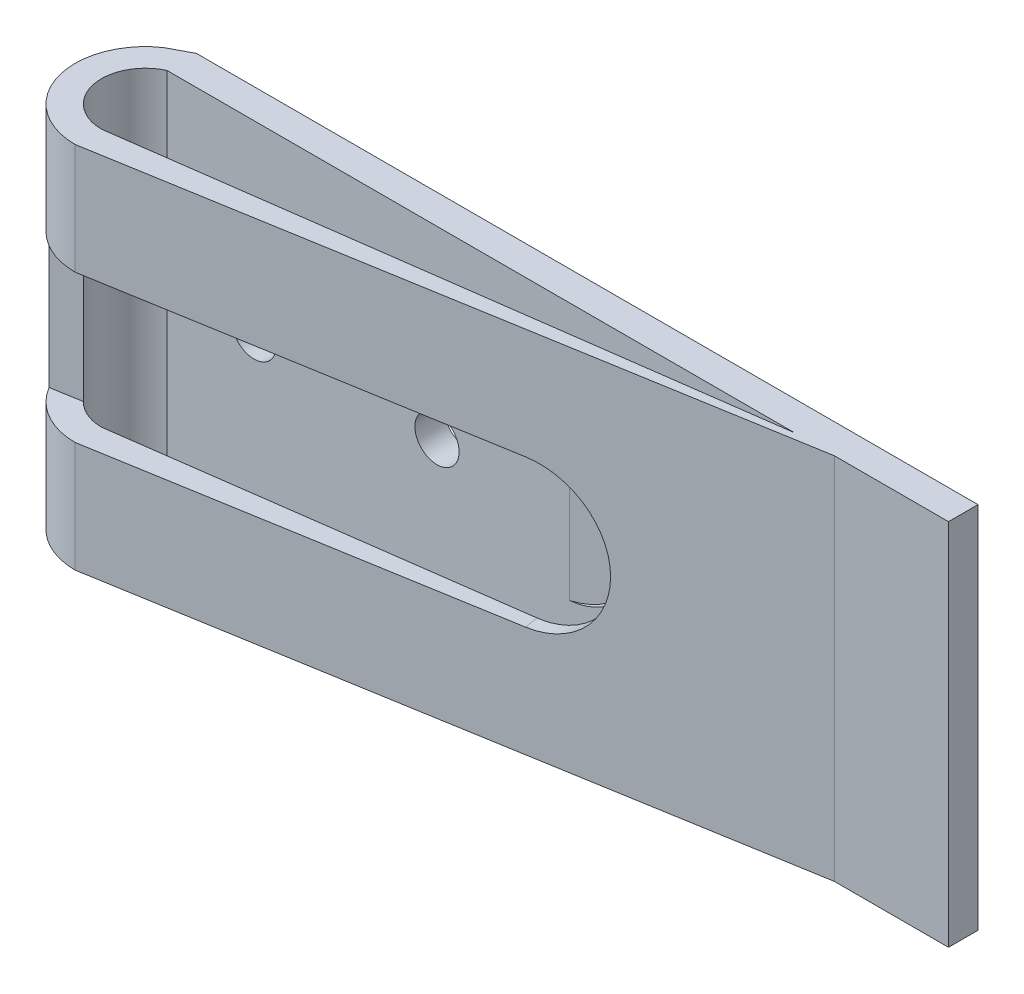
ISO-10303-21;
HEADER;
FILE_DESCRIPTION(('STEP AP214'),'2;1');
FILE_NAME('part.step','',(''),(''),'','','');
FILE_SCHEMA(('AUTOMOTIVE_DESIGN { 1 0 10303 214 1 1 1 1 }'));
ENDSEC;
DATA;
#1=APPLICATION_CONTEXT('core data for automotive mechanical design processes');
#2=APPLICATION_PROTOCOL_DEFINITION('international standard','automotive_design',2000,#1);
#3=PRODUCT_CONTEXT('',#1,'mechanical');
#4=PRODUCT('Part','Part','',(#3));
#5=PRODUCT_RELATED_PRODUCT_CATEGORY('part','',(#4));
#6=PRODUCT_DEFINITION_FORMATION('','',#4);
#7=PRODUCT_DEFINITION_CONTEXT('part definition',#1,'design');
#8=PRODUCT_DEFINITION('design','',#6,#7);
#9=PRODUCT_DEFINITION_SHAPE('','',#8);
#10=(LENGTH_UNIT() NAMED_UNIT(*) SI_UNIT(.MILLI.,.METRE.));
#11=(NAMED_UNIT(*) PLANE_ANGLE_UNIT() SI_UNIT($,.RADIAN.));
#12=(NAMED_UNIT(*) SI_UNIT($,.STERADIAN.) SOLID_ANGLE_UNIT());
#13=UNCERTAINTY_MEASURE_WITH_UNIT(LENGTH_MEASURE(1.E-05),#10,'distance_accuracy_value','');
#14=(GEOMETRIC_REPRESENTATION_CONTEXT(3) GLOBAL_UNCERTAINTY_ASSIGNED_CONTEXT((#13)) GLOBAL_UNIT_ASSIGNED_CONTEXT((#10,
#11,#12)) REPRESENTATION_CONTEXT('',''));
#15=CARTESIAN_POINT('',(0.,0.,0.));
#16=DIRECTION('',(0.,0.,1.));
#17=DIRECTION('',(1.,0.,0.));
#18=AXIS2_PLACEMENT_3D('',#15,#16,#17);
#19=CARTESIAN_POINT('',(0.,0.,2.));
#20=DIRECTION('',(0.,0.,1.));
#21=DIRECTION('',(1.,0.,0.));
#22=AXIS2_PLACEMENT_3D('',#19,#20,#21);
#23=PLANE('',#22);
#24=DIRECTION('',(0.,-1.,0.));
#25=VECTOR('',#24,1.);
#26=CARTESIAN_POINT('',(18.7566600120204,12.5,2.));
#27=LINE('',#26,#25);
#28=CARTESIAN_POINT('',(18.7566600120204,12.5,2.));
#29=VERTEX_POINT('',#28);
#30=CARTESIAN_POINT('',(18.7566600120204,-12.5,2.));
#31=VERTEX_POINT('',#30);
#32=EDGE_CURVE('E261',#29,#31,#27,.T.);
#33=ORIENTED_EDGE('',*,*,#32,.T.);
#34=DIRECTION('',(1.,0.,0.));
#35=VECTOR('',#34,1.);
#36=CARTESIAN_POINT('',(-26.5,-12.5,2.));
#37=LINE('',#36,#35);
#38=CARTESIAN_POINT('',(26.5,-12.5,2.));
#39=VERTEX_POINT('',#38);
#40=EDGE_CURVE('E292',#31,#39,#37,.T.);
#41=ORIENTED_EDGE('',*,*,#40,.T.);
#42=DIRECTION('',(0.,1.,0.));
#43=VECTOR('',#42,1.);
#44=CARTESIAN_POINT('',(26.5,12.5,2.));
#45=LINE('',#44,#43);
#46=CARTESIAN_POINT('',(26.5,12.5,2.));
#47=VERTEX_POINT('',#46);
#48=EDGE_CURVE('E297',#39,#47,#45,.T.);
#49=ORIENTED_EDGE('',*,*,#48,.T.);
#50=DIRECTION('',(-1.,0.,0.));
#51=VECTOR('',#50,1.);
#52=CARTESIAN_POINT('',(-26.5,12.5,2.));
#53=LINE('',#52,#51);
#54=EDGE_CURVE('E301',#47,#29,#53,.T.);
#55=ORIENTED_EDGE('',*,*,#54,.T.);
#56=EDGE_LOOP('',(#33,#41,#49,#55));
#57=FACE_BOUND('',#56,.T.);
#58=ADVANCED_FACE('F45',(#57),#23,.T.);
#59=CARTESIAN_POINT('',(0.33904173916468,0.,2.));
#60=DIRECTION('',(0.,0.,1.));
#61=DIRECTION('',(1.,0.,0.));
#62=AXIS2_PLACEMENT_3D('',#59,#60,#61);
#63=ELLIPSE('',#62,5.07133445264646,5.00000000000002);
#64=CARTESIAN_POINT('',(0.807243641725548,-4.97864545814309,2.));
#65=VERTEX_POINT('',#64);
#66=CARTESIAN_POINT('',(0.807243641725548,4.97864545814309,2.));
#67=VERTEX_POINT('',#66);
#68=EDGE_CURVE('E209',#65,#67,#63,.T.);
#69=ORIENTED_EDGE('',*,*,#68,.F.);
#70=DIRECTION('',(0.,1.,0.));
#71=VECTOR('',#70,1.);
#72=CARTESIAN_POINT('',(0.807243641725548,0.,2.));
#73=LINE('',#72,#71);
#74=EDGE_CURVE('E194',#65,#67,#73,.T.);
#75=ORIENTED_EDGE('',*,*,#74,.T.);
#76=EDGE_LOOP('',(#69,#75));
#77=FACE_BOUND('',#76,.T.);
#78=DIRECTION('',(0.,-1.,0.));
#79=VECTOR('',#78,1.);
#80=CARTESIAN_POINT('',(16.0699554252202,12.5,2.));
#81=LINE('',#80,#79);
#82=CARTESIAN_POINT('',(16.0699554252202,12.5,2.));
#83=VERTEX_POINT('',#82);
#84=CARTESIAN_POINT('',(16.0699554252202,-12.5,2.));
#85=VERTEX_POINT('',#84);
#86=EDGE_CURVE('E264',#83,#85,#81,.T.);
#87=ORIENTED_EDGE('',*,*,#86,.F.);
#88=CARTESIAN_POINT('',(-26.5,12.5,2.));
#89=VERTEX_POINT('',#88);
#90=EDGE_CURVE('E300',#83,#89,#53,.T.);
#91=ORIENTED_EDGE('',*,*,#90,.T.);
#92=DIRECTION('',(0.,-1.,0.));
#93=VECTOR('',#92,1.);
#94=CARTESIAN_POINT('',(-26.5,12.5,2.));
#95=LINE('',#94,#93);
#96=CARTESIAN_POINT('',(-26.5,-12.5,2.));
#97=VERTEX_POINT('',#96);
#98=EDGE_CURVE('E288',#89,#97,#95,.T.);
#99=ORIENTED_EDGE('',*,*,#98,.T.);
#100=EDGE_CURVE('E294',#97,#85,#37,.T.);
#101=ORIENTED_EDGE('',*,*,#100,.T.);
#102=EDGE_LOOP('',(#87,#91,#99,#101));
#103=FACE_BOUND('',#102,.T.);
#104=CARTESIAN_POINT('',(-20.5983535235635,0.,2.));
#105=DIRECTION('',(0.,0.,1.));
#106=DIRECTION('',(1.,0.,0.));
#107=AXIS2_PLACEMENT_3D('',#104,#105,#106);
#108=CIRCLE('',#107,1.5);
#109=CARTESIAN_POINT('',(-19.0983535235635,0.,2.));
#110=VERTEX_POINT('',#109);
#111=EDGE_CURVE('E280',#110,#110,#108,.T.);
#112=ORIENTED_EDGE('',*,*,#111,.F.);
#113=EDGE_LOOP('',(#112));
#114=FACE_BOUND('',#113,.T.);
#115=CARTESIAN_POINT('',(-8.1881653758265,0.,2.));
#116=DIRECTION('',(0.,0.,1.));
#117=DIRECTION('',(1.,0.,0.));
#118=AXIS2_PLACEMENT_3D('',#115,#116,#117);
#119=CIRCLE('',#118,1.5);
#120=CARTESIAN_POINT('',(-6.6881653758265,0.,2.));
#121=VERTEX_POINT('',#120);
#122=EDGE_CURVE('E272',#121,#121,#119,.T.);
#123=ORIENTED_EDGE('',*,*,#122,.F.);
#124=EDGE_LOOP('',(#123));
#125=FACE_BOUND('',#124,.T.);
#126=ADVANCED_FACE('F357',(#77,#103,#114,#125),#23,.T.);
#127=CARTESIAN_POINT('',(0.,0.,0.));
#128=DIRECTION('',(0.,0.,1.));
#129=DIRECTION('',(1.,0.,0.));
#130=AXIS2_PLACEMENT_3D('',#127,#128,#129);
#131=PLANE('',#130);
#132=DIRECTION('',(0.,-1.,0.));
#133=VECTOR('',#132,1.);
#134=CARTESIAN_POINT('',(-26.5,12.5,0.));
#135=LINE('',#134,#133);
#136=CARTESIAN_POINT('',(-26.5,12.5,0.));
#137=VERTEX_POINT('',#136);
#138=CARTESIAN_POINT('',(-26.5,-12.5,0.));
#139=VERTEX_POINT('',#138);
#140=EDGE_CURVE('E284',#137,#139,#135,.T.);
#141=ORIENTED_EDGE('',*,*,#140,.F.);
#142=DIRECTION('',(-1.,0.,0.));
#143=VECTOR('',#142,1.);
#144=CARTESIAN_POINT('',(-26.5,12.5,0.));
#145=LINE('',#144,#143);
#146=CARTESIAN_POINT('',(26.5,12.5,0.));
#147=VERTEX_POINT('',#146);
#148=EDGE_CURVE('E293',#147,#137,#145,.T.);
#149=ORIENTED_EDGE('',*,*,#148,.F.);
#150=DIRECTION('',(0.,1.,0.));
#151=VECTOR('',#150,1.);
#152=CARTESIAN_POINT('',(26.5,12.5,0.));
#153=LINE('',#152,#151);
#154=CARTESIAN_POINT('',(26.5,-12.5,0.));
#155=VERTEX_POINT('',#154);
#156=EDGE_CURVE('E311',#155,#147,#153,.T.);
#157=ORIENTED_EDGE('',*,*,#156,.F.);
#158=DIRECTION('',(1.,0.,0.));
#159=VECTOR('',#158,1.);
#160=CARTESIAN_POINT('',(-26.5,-12.5,0.));
#161=LINE('',#160,#159);
#162=EDGE_CURVE('E308',#139,#155,#161,.T.);
#163=ORIENTED_EDGE('',*,*,#162,.F.);
#164=EDGE_LOOP('',(#141,#149,#157,#163));
#165=FACE_BOUND('',#164,.T.);
#166=CARTESIAN_POINT('',(-20.5983535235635,0.,0.));
#167=DIRECTION('',(0.,0.,1.));
#168=DIRECTION('',(1.,0.,0.));
#169=AXIS2_PLACEMENT_3D('',#166,#167,#168);
#170=CIRCLE('',#169,1.5);
#171=CARTESIAN_POINT('',(-19.0983535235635,0.,0.));
#172=VERTEX_POINT('',#171);
#173=EDGE_CURVE('E276',#172,#172,#170,.T.);
#174=ORIENTED_EDGE('',*,*,#173,.T.);
#175=EDGE_LOOP('',(#174));
#176=FACE_BOUND('',#175,.T.);
#177=CARTESIAN_POINT('',(-8.1881653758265,0.,0.));
#178=DIRECTION('',(0.,0.,1.));
#179=DIRECTION('',(1.,0.,0.));
#180=AXIS2_PLACEMENT_3D('',#177,#178,#179);
#181=CIRCLE('',#180,1.5);
#182=CARTESIAN_POINT('',(-6.6881653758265,0.,0.));
#183=VERTEX_POINT('',#182);
#184=EDGE_CURVE('E256',#183,#183,#181,.T.);
#185=ORIENTED_EDGE('',*,*,#184,.T.);
#186=EDGE_LOOP('',(#185));
#187=FACE_BOUND('',#186,.T.);
#188=ADVANCED_FACE('F385',(#165,#176,#187),#131,.F.);
#189=CARTESIAN_POINT('',(-26.5,-12.5,2.));
#190=DIRECTION('',(0.,1.,0.));
#191=DIRECTION('',(0.,0.,1.));
#192=AXIS2_PLACEMENT_3D('',#189,#190,#191);
#193=PLANE('',#192);
#194=DIRECTION('',(0.884045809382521,0.,-0.467400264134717));
#195=VECTOR('',#194,1.);
#196=CARTESIAN_POINT('',(-26.5,-12.5,0.));
#197=LINE('',#196,#195);
#198=CARTESIAN_POINT('',(-27.9487701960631,-12.5,0.765973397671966));
#199=VERTEX_POINT('',#198);
#200=EDGE_CURVE('E218',#199,#139,#197,.T.);
#201=ORIENTED_EDGE('',*,*,#200,.T.);
#202=ORIENTED_EDGE('',*,*,#162,.T.);
#203=DIRECTION('',(0.,0.,-1.));
#204=VECTOR('',#203,1.);
#205=CARTESIAN_POINT('',(26.5,-12.5,2.));
#206=LINE('',#205,#204);
#207=EDGE_CURVE('E320',#39,#155,#206,.T.);
#208=ORIENTED_EDGE('',*,*,#207,.F.);
#209=ORIENTED_EDGE('',*,*,#40,.F.);
#210=DIRECTION('',(-0.985933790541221,0.,0.16713635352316));
#211=VECTOR('',#210,1.);
#212=CARTESIAN_POINT('',(-25.270115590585,-12.5,9.46345728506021));
#213=LINE('',#212,#211);
#214=CARTESIAN_POINT('',(-25.270115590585,-12.5,9.46345728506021));
#215=VERTEX_POINT('',#214);
#216=EDGE_CURVE('E242',#31,#215,#213,.T.);
#217=ORIENTED_EDGE('',*,*,#216,.T.);
#218=CARTESIAN_POINT('',(-25.270115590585,-12.5,4.70222877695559));
#219=DIRECTION('',(0.,-1.,0.));
#220=DIRECTION('',(0.,0.,-1.));
#221=AXIS2_PLACEMENT_3D('',#218,#219,#220);
#222=CIRCLE('',#221,4.76122850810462);
#223=EDGE_CURVE('E246',#215,#199,#222,.T.);
#224=ORIENTED_EDGE('',*,*,#223,.T.);
#225=EDGE_LOOP('',(#201,#202,#208,#209,#217,#224));
#226=FACE_BOUND('',#225,.T.);
#227=ORIENTED_EDGE('',*,*,#100,.F.);
#228=CARTESIAN_POINT('',(-25.270115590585,-12.5,4.70222877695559));
#229=DIRECTION('',(0.,1.,0.));
#230=DIRECTION('',(0.,0.,-1.));
#231=AXIS2_PLACEMENT_3D('',#228,#229,#230);
#232=CIRCLE('',#231,2.96894863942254);
#233=CARTESIAN_POINT('',(-25.270115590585,-12.5,7.67117741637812));
#234=VERTEX_POINT('',#233);
#235=EDGE_CURVE('E212',#97,#234,#232,.T.);
#236=ORIENTED_EDGE('',*,*,#235,.T.);
#237=DIRECTION('',(0.990721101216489,0.,-0.135910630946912));
#238=VECTOR('',#237,1.);
#239=CARTESIAN_POINT('',(-25.270115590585,-12.5,7.67117741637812));
#240=LINE('',#239,#238);
#241=EDGE_CURVE('E238',#234,#85,#240,.T.);
#242=ORIENTED_EDGE('',*,*,#241,.T.);
#243=EDGE_LOOP('',(#227,#236,#242));
#244=FACE_BOUND('',#243,.T.);
#245=ADVANCED_FACE('F47',(#226,#244),#193,.F.);
#246=CARTESIAN_POINT('',(26.5,12.5,2.));
#247=DIRECTION('',(-1.,0.,0.));
#248=DIRECTION('',(0.,-1.,0.));
#249=AXIS2_PLACEMENT_3D('',#246,#247,#248);
#250=PLANE('',#249);
#251=ORIENTED_EDGE('',*,*,#156,.T.);
#252=DIRECTION('',(0.,0.,-1.));
#253=VECTOR('',#252,1.);
#254=CARTESIAN_POINT('',(26.5,12.5,2.));
#255=LINE('',#254,#253);
#256=EDGE_CURVE('E304',#47,#147,#255,.T.);
#257=ORIENTED_EDGE('',*,*,#256,.F.);
#258=ORIENTED_EDGE('',*,*,#48,.F.);
#259=ORIENTED_EDGE('',*,*,#207,.T.);
#260=EDGE_LOOP('',(#251,#257,#258,#259));
#261=FACE_BOUND('',#260,.T.);
#262=ADVANCED_FACE('F391',(#261),#250,.F.);
#263=CARTESIAN_POINT('',(-26.5,12.5,2.));
#264=DIRECTION('',(0.,-1.,0.));
#265=DIRECTION('',(0.,0.,-1.));
#266=AXIS2_PLACEMENT_3D('',#263,#264,#265);
#267=PLANE('',#266);
#268=ORIENTED_EDGE('',*,*,#148,.T.);
#269=DIRECTION('',(0.884045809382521,0.,-0.467400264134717));
#270=VECTOR('',#269,1.);
#271=CARTESIAN_POINT('',(-26.5,12.5,0.));
#272=LINE('',#271,#270);
#273=CARTESIAN_POINT('',(-27.9487701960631,12.5,0.765973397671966));
#274=VERTEX_POINT('',#273);
#275=EDGE_CURVE('E230',#274,#137,#272,.T.);
#276=ORIENTED_EDGE('',*,*,#275,.F.);
#277=CARTESIAN_POINT('',(-25.270115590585,12.5,4.70222877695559));
#278=DIRECTION('',(0.,-1.,0.));
#279=DIRECTION('',(0.,0.,-1.));
#280=AXIS2_PLACEMENT_3D('',#277,#278,#279);
#281=CIRCLE('',#280,4.76122850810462);
#282=CARTESIAN_POINT('',(-25.270115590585,12.5,9.46345728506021));
#283=VERTEX_POINT('',#282);
#284=EDGE_CURVE('E226',#283,#274,#281,.T.);
#285=ORIENTED_EDGE('',*,*,#284,.F.);
#286=DIRECTION('',(-0.985933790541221,0.,0.16713635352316));
#287=VECTOR('',#286,1.);
#288=CARTESIAN_POINT('',(-25.270115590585,12.5,9.46345728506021));
#289=LINE('',#288,#287);
#290=EDGE_CURVE('E222',#29,#283,#289,.T.);
#291=ORIENTED_EDGE('',*,*,#290,.F.);
#292=ORIENTED_EDGE('',*,*,#54,.F.);
#293=ORIENTED_EDGE('',*,*,#256,.T.);
#294=EDGE_LOOP('',(#268,#276,#285,#291,#292,#293));
#295=FACE_BOUND('',#294,.T.);
#296=CARTESIAN_POINT('',(-25.270115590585,12.5,4.70222877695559));
#297=DIRECTION('',(0.,1.,0.));
#298=DIRECTION('',(0.,0.,-1.));
#299=AXIS2_PLACEMENT_3D('',#296,#297,#298);
#300=CIRCLE('',#299,2.96894863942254);
#301=CARTESIAN_POINT('',(-25.270115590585,12.5,7.67117741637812));
#302=VERTEX_POINT('',#301);
#303=EDGE_CURVE('E213',#89,#302,#300,.T.);
#304=ORIENTED_EDGE('',*,*,#303,.F.);
#305=ORIENTED_EDGE('',*,*,#90,.F.);
#306=DIRECTION('',(0.990721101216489,0.,-0.135910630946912));
#307=VECTOR('',#306,1.);
#308=CARTESIAN_POINT('',(-25.270115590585,12.5,7.67117741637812));
#309=LINE('',#308,#307);
#310=EDGE_CURVE('E217',#302,#83,#309,.T.);
#311=ORIENTED_EDGE('',*,*,#310,.F.);
#312=EDGE_LOOP('',(#304,#305,#311));
#313=FACE_BOUND('',#312,.T.);
#314=ADVANCED_FACE('F363',(#295,#313),#267,.F.);
#315=CARTESIAN_POINT('',(-20.5983535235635,0.,2.));
#316=DIRECTION('',(0.,0.,-1.));
#317=DIRECTION('',(-1.,0.,0.));
#318=AXIS2_PLACEMENT_3D('',#315,#316,#317);
#319=CYLINDRICAL_SURFACE('',#318,1.5);
#320=ORIENTED_EDGE('',*,*,#111,.T.);
#321=EDGE_LOOP('',(#320));
#322=FACE_BOUND('',#321,.T.);
#323=ORIENTED_EDGE('',*,*,#173,.F.);
#324=EDGE_LOOP('',(#323));
#325=FACE_BOUND('',#324,.T.);
#326=ADVANCED_FACE('F404',(#322,#325),#319,.F.);
#327=CARTESIAN_POINT('',(-8.1881653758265,0.,2.));
#328=DIRECTION('',(0.,0.,-1.));
#329=DIRECTION('',(-1.,0.,0.));
#330=AXIS2_PLACEMENT_3D('',#327,#328,#329);
#331=CYLINDRICAL_SURFACE('',#330,1.5);
#332=ORIENTED_EDGE('',*,*,#122,.T.);
#333=EDGE_LOOP('',(#332));
#334=FACE_BOUND('',#333,.T.);
#335=ORIENTED_EDGE('',*,*,#184,.F.);
#336=EDGE_LOOP('',(#335));
#337=FACE_BOUND('',#336,.T.);
#338=ADVANCED_FACE('F429',(#334,#337),#331,.F.);
#339=CARTESIAN_POINT('',(-26.5,12.5,0.));
#340=DIRECTION('',(-0.467400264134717,0.,-0.884045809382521));
#341=DIRECTION('',(-0.884045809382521,0.,0.467400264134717));
#342=AXIS2_PLACEMENT_3D('',#339,#340,#341);
#343=PLANE('',#342);
#344=ORIENTED_EDGE('',*,*,#200,.F.);
#345=DIRECTION('',(0.,-1.,0.));
#346=VECTOR('',#345,1.);
#347=CARTESIAN_POINT('',(-27.9487701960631,12.5,0.765973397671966));
#348=LINE('',#347,#346);
#349=EDGE_CURVE('E253',#274,#199,#348,.T.);
#350=ORIENTED_EDGE('',*,*,#349,.F.);
#351=ORIENTED_EDGE('',*,*,#275,.T.);
#352=ORIENTED_EDGE('',*,*,#140,.T.);
#353=EDGE_LOOP('',(#344,#350,#351,#352));
#354=FACE_BOUND('',#353,.T.);
#355=ADVANCED_FACE('F382',(#354),#343,.T.);
#356=CARTESIAN_POINT('',(-25.270115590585,12.5,4.70222877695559));
#357=DIRECTION('',(0.,-1.,0.));
#358=DIRECTION('',(0.,0.,-1.));
#359=AXIS2_PLACEMENT_3D('',#356,#357,#358);
#360=CYLINDRICAL_SURFACE('',#359,4.76122850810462);
#361=CARTESIAN_POINT('',(-25.270115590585,-5.00000000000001,4.70222877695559));
#362=DIRECTION('',(0.,-1.,0.));
#363=DIRECTION('',(1.,0.,0.));
#364=AXIS2_PLACEMENT_3D('',#361,#362,#363);
#365=CIRCLE('',#364,4.76122850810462);
#366=CARTESIAN_POINT('',(-29.3739385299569,-5.00000000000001,7.11634024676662));
#367=VERTEX_POINT('',#366);
#368=CARTESIAN_POINT('',(-25.270115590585,-5.00000000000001,9.46345728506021));
#369=VERTEX_POINT('',#368);
#370=EDGE_CURVE('E172',#367,#369,#365,.F.);
#371=ORIENTED_EDGE('',*,*,#370,.F.);
#372=DIRECTION('',(0.,-1.,0.));
#373=VECTOR('',#372,1.);
#374=CARTESIAN_POINT('',(-29.3739385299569,12.5,7.11634024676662));
#375=LINE('',#374,#373);
#376=CARTESIAN_POINT('',(-29.3739385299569,5.00000000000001,7.11634024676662));
#377=VERTEX_POINT('',#376);
#378=EDGE_CURVE('E164',#367,#377,#375,.F.);
#379=ORIENTED_EDGE('',*,*,#378,.T.);
#380=CARTESIAN_POINT('',(-25.270115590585,5.00000000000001,4.70222877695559));
#381=DIRECTION('',(0.,1.,0.));
#382=DIRECTION('',(-1.,0.,0.));
#383=AXIS2_PLACEMENT_3D('',#380,#381,#382);
#384=CIRCLE('',#383,4.76122850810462);
#385=CARTESIAN_POINT('',(-25.270115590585,5.00000000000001,9.46345728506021));
#386=VERTEX_POINT('',#385);
#387=EDGE_CURVE('E201',#386,#377,#384,.F.);
#388=ORIENTED_EDGE('',*,*,#387,.F.);
#389=DIRECTION('',(0.,-1.,0.));
#390=VECTOR('',#389,1.);
#391=CARTESIAN_POINT('',(-25.270115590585,12.5,9.46345728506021));
#392=LINE('',#391,#390);
#393=EDGE_CURVE('E257',#283,#386,#392,.T.);
#394=ORIENTED_EDGE('',*,*,#393,.F.);
#395=ORIENTED_EDGE('',*,*,#284,.T.);
#396=ORIENTED_EDGE('',*,*,#349,.T.);
#397=ORIENTED_EDGE('',*,*,#223,.F.);
#398=EDGE_CURVE('E260',#369,#215,#392,.T.);
#399=ORIENTED_EDGE('',*,*,#398,.F.);
#400=EDGE_LOOP('',(#371,#379,#388,#394,#395,#396,#397,#399));
#401=FACE_BOUND('',#400,.T.);
#402=ADVANCED_FACE('F368',(#401),#360,.T.);
#403=CARTESIAN_POINT('',(-25.270115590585,12.5,9.46345728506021));
#404=DIRECTION('',(0.16713635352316,0.,0.985933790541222));
#405=DIRECTION('',(0.985933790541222,0.,-0.16713635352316));
#406=AXIS2_PLACEMENT_3D('',#403,#404,#405);
#407=PLANE('',#406);
#408=DIRECTION('',(0.985933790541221,0.,-0.16713635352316));
#409=VECTOR('',#408,1.);
#410=CARTESIAN_POINT('',(0.853529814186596,-5.00000000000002,5.03495419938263));
#411=LINE('',#410,#409);
#412=CARTESIAN_POINT('',(0.853529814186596,-5.00000000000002,5.03495419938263));
#413=VERTEX_POINT('',#412);
#414=EDGE_CURVE('E168',#369,#413,#411,.T.);
#415=ORIENTED_EDGE('',*,*,#414,.F.);
#416=ORIENTED_EDGE('',*,*,#398,.T.);
#417=ORIENTED_EDGE('',*,*,#216,.F.);
#418=ORIENTED_EDGE('',*,*,#32,.F.);
#419=ORIENTED_EDGE('',*,*,#290,.T.);
#420=ORIENTED_EDGE('',*,*,#393,.T.);
#421=DIRECTION('',(-0.985933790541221,0.,0.16713635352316));
#422=VECTOR('',#421,1.);
#423=CARTESIAN_POINT('',(0.853529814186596,5.00000000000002,5.03495419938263));
#424=LINE('',#423,#422);
#425=CARTESIAN_POINT('',(0.853529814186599,5.00000000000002,5.03495419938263));
#426=VERTEX_POINT('',#425);
#427=EDGE_CURVE('E176',#426,#386,#424,.T.);
#428=ORIENTED_EDGE('',*,*,#427,.F.);
#429=CARTESIAN_POINT('',(0.853529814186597,0.,5.03495419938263));
#430=DIRECTION('',(0.16713635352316,0.,0.985933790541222));
#431=DIRECTION('',(0.985933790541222,0.,-0.16713635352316));
#432=AXIS2_PLACEMENT_3D('',#429,#430,#431);
#433=CIRCLE('',#432,5.00000000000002);
#434=EDGE_CURVE('E68',#413,#426,#433,.T.);
#435=ORIENTED_EDGE('',*,*,#434,.F.);
#436=EDGE_LOOP('',(#415,#416,#417,#418,#419,#420,#428,#435));
#437=FACE_BOUND('',#436,.T.);
#438=ADVANCED_FACE('F179',(#437),#407,.T.);
#439=CARTESIAN_POINT('',(-25.270115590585,12.5,7.67117741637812));
#440=DIRECTION('',(-0.135910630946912,0.,-0.990721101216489));
#441=DIRECTION('',(-0.990721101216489,0.,0.135910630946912));
#442=AXIS2_PLACEMENT_3D('',#439,#440,#441);
#443=PLANE('',#442);
#444=DIRECTION('',(-0.990721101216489,0.,0.135910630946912));
#445=VECTOR('',#444,1.);
#446=CARTESIAN_POINT('',(-25.270115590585,-5.00000000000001,7.67117741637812));
#447=LINE('',#446,#445);
#448=CARTESIAN_POINT('',(0.696557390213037,-5.00000000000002,4.10897721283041));
#449=VERTEX_POINT('',#448);
#450=CARTESIAN_POINT('',(-25.270115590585,-5.00000000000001,7.67117741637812));
#451=VERTEX_POINT('',#450);
#452=EDGE_CURVE('E204',#449,#451,#447,.T.);
#453=ORIENTED_EDGE('',*,*,#452,.F.);
#454=CARTESIAN_POINT('',(0.696557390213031,0.,4.10897721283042));
#455=DIRECTION('',(-0.135910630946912,0.,-0.990721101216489));
#456=DIRECTION('',(0.990721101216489,0.,-0.135910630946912));
#457=AXIS2_PLACEMENT_3D('',#454,#455,#456);
#458=ELLIPSE('',#457,5.00249615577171,5.00000000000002);
#459=CARTESIAN_POINT('',(0.696557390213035,5.00000000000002,4.10897721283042));
#460=VERTEX_POINT('',#459);
#461=EDGE_CURVE('E11',#460,#449,#458,.T.);
#462=ORIENTED_EDGE('',*,*,#461,.F.);
#463=DIRECTION('',(0.990721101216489,0.,-0.135910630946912));
#464=VECTOR('',#463,1.);
#465=CARTESIAN_POINT('',(-25.270115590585,5.00000000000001,7.67117741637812));
#466=LINE('',#465,#464);
#467=CARTESIAN_POINT('',(-25.270115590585,5.00000000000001,7.67117741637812));
#468=VERTEX_POINT('',#467);
#469=EDGE_CURVE('E198',#468,#460,#466,.T.);
#470=ORIENTED_EDGE('',*,*,#469,.F.);
#471=DIRECTION('',(0.,-1.,0.));
#472=VECTOR('',#471,1.);
#473=CARTESIAN_POINT('',(-25.270115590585,12.5,7.67117741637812));
#474=LINE('',#473,#472);
#475=EDGE_CURVE('E268',#302,#468,#474,.T.);
#476=ORIENTED_EDGE('',*,*,#475,.F.);
#477=ORIENTED_EDGE('',*,*,#310,.T.);
#478=ORIENTED_EDGE('',*,*,#86,.T.);
#479=ORIENTED_EDGE('',*,*,#241,.F.);
#480=EDGE_CURVE('E234',#451,#234,#474,.T.);
#481=ORIENTED_EDGE('',*,*,#480,.F.);
#482=EDGE_LOOP('',(#453,#462,#470,#476,#477,#478,#479,#481));
#483=FACE_BOUND('',#482,.T.);
#484=ADVANCED_FACE('F365',(#483),#443,.T.);
#485=CARTESIAN_POINT('',(-25.270115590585,12.5,4.70222877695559));
#486=DIRECTION('',(0.,-1.,0.));
#487=DIRECTION('',(0.,0.,-1.));
#488=AXIS2_PLACEMENT_3D('',#485,#486,#487);
#489=CYLINDRICAL_SURFACE('',#488,2.96894863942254);
#490=CARTESIAN_POINT('',(-25.270115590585,-5.00000000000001,4.70222877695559));
#491=DIRECTION('',(0.,-1.,0.));
#492=DIRECTION('',(1.,0.,0.));
#493=AXIS2_PLACEMENT_3D('',#490,#491,#492);
#494=CIRCLE('',#493,2.96894863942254);
#495=CARTESIAN_POINT('',(-27.3907127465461,-5.00000000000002,6.78014208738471));
#496=VERTEX_POINT('',#495);
#497=EDGE_CURVE('E54',#451,#496,#494,.T.);
#498=ORIENTED_EDGE('',*,*,#497,.F.);
#499=ORIENTED_EDGE('',*,*,#480,.T.);
#500=ORIENTED_EDGE('',*,*,#235,.F.);
#501=ORIENTED_EDGE('',*,*,#98,.F.);
#502=ORIENTED_EDGE('',*,*,#303,.T.);
#503=ORIENTED_EDGE('',*,*,#475,.T.);
#504=CARTESIAN_POINT('',(-25.270115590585,5.00000000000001,4.70222877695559));
#505=DIRECTION('',(0.,1.,0.));
#506=DIRECTION('',(-1.,0.,0.));
#507=AXIS2_PLACEMENT_3D('',#504,#505,#506);
#508=CIRCLE('',#507,2.96894863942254);
#509=CARTESIAN_POINT('',(-27.3907127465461,5.00000000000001,6.78014208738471));
#510=VERTEX_POINT('',#509);
#511=EDGE_CURVE('E328',#510,#468,#508,.T.);
#512=ORIENTED_EDGE('',*,*,#511,.F.);
#513=DIRECTION('',(0.,-1.,0.));
#514=VECTOR('',#513,1.);
#515=CARTESIAN_POINT('',(-27.3907127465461,12.5,6.78014208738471));
#516=LINE('',#515,#514);
#517=EDGE_CURVE('E324',#510,#496,#516,.T.);
#518=ORIENTED_EDGE('',*,*,#517,.T.);
#519=EDGE_LOOP('',(#498,#499,#500,#501,#502,#503,#512,#518));
#520=FACE_BOUND('',#519,.T.);
#521=ADVANCED_FACE('F336',(#520),#489,.F.);
#522=CARTESIAN_POINT('',(0.352120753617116,0.,2.07715282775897));
#523=DIRECTION('',(0.16713635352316,0.,0.985933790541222));
#524=DIRECTION('',(0.985933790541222,0.,-0.16713635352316));
#525=AXIS2_PLACEMENT_3D('',#522,#523,#524);
#526=PLANE('',#525);
#527=DIRECTION('',(0.985933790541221,0.,-0.16713635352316));
#528=VECTOR('',#527,1.);
#529=CARTESIAN_POINT('',(0.352120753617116,-5.00000000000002,2.07715282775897));
#530=LINE('',#529,#528);
#531=EDGE_CURVE('E186',#367,#496,#530,.T.);
#532=ORIENTED_EDGE('',*,*,#531,.T.);
#533=ORIENTED_EDGE('',*,*,#517,.F.);
#534=DIRECTION('',(-0.985933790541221,0.,0.16713635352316));
#535=VECTOR('',#534,1.);
#536=CARTESIAN_POINT('',(0.352120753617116,5.00000000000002,2.07715282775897));
#537=LINE('',#536,#535);
#538=EDGE_CURVE('E341',#510,#377,#537,.T.);
#539=ORIENTED_EDGE('',*,*,#538,.T.);
#540=ORIENTED_EDGE('',*,*,#378,.F.);
#541=EDGE_LOOP('',(#532,#533,#539,#540));
#542=FACE_BOUND('',#541,.T.);
#543=ADVANCED_FACE('F340',(#542),#526,.T.);
#544=CARTESIAN_POINT('',(0.352120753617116,5.00000000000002,2.07715282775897));
#545=DIRECTION('',(0.,1.,0.));
#546=DIRECTION('',(-1.,0.,0.));
#547=AXIS2_PLACEMENT_3D('',#544,#545,#546);
#548=PLANE('',#547);
#549=ORIENTED_EDGE('',*,*,#387,.T.);
#550=ORIENTED_EDGE('',*,*,#538,.F.);
#551=ORIENTED_EDGE('',*,*,#511,.T.);
#552=ORIENTED_EDGE('',*,*,#469,.T.);
#553=DIRECTION('',(0.16713635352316,0.,0.985933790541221));
#554=VECTOR('',#553,1.);
#555=CARTESIAN_POINT('',(0.352120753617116,5.00000000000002,2.07715282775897));
#556=LINE('',#555,#554);
#557=EDGE_CURVE('E165',#460,#426,#556,.T.);
#558=ORIENTED_EDGE('',*,*,#557,.T.);
#559=ORIENTED_EDGE('',*,*,#427,.T.);
#560=EDGE_LOOP('',(#549,#550,#551,#552,#558,#559));
#561=FACE_BOUND('',#560,.T.);
#562=ADVANCED_FACE('F343',(#561),#548,.F.);
#563=CARTESIAN_POINT('',(0.352120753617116,-5.00000000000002,2.07715282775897));
#564=DIRECTION('',(0.,-1.,0.));
#565=DIRECTION('',(1.,0.,0.));
#566=AXIS2_PLACEMENT_3D('',#563,#564,#565);
#567=PLANE('',#566);
#568=ORIENTED_EDGE('',*,*,#370,.T.);
#569=ORIENTED_EDGE('',*,*,#414,.T.);
#570=DIRECTION('',(0.16713635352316,0.,0.985933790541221));
#571=VECTOR('',#570,1.);
#572=CARTESIAN_POINT('',(0.352120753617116,-5.00000000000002,2.07715282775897));
#573=LINE('',#572,#571);
#574=EDGE_CURVE('E157',#449,#413,#573,.T.);
#575=ORIENTED_EDGE('',*,*,#574,.F.);
#576=ORIENTED_EDGE('',*,*,#452,.T.);
#577=ORIENTED_EDGE('',*,*,#497,.T.);
#578=ORIENTED_EDGE('',*,*,#531,.F.);
#579=EDGE_LOOP('',(#568,#569,#575,#576,#577,#578));
#580=FACE_BOUND('',#579,.T.);
#581=ADVANCED_FACE('F169',(#580),#567,.F.);
#582=CARTESIAN_POINT('',(0.352120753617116,0.,2.07715282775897));
#583=DIRECTION('',(0.16713635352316,0.,0.985933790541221));
#584=DIRECTION('',(0.985933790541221,0.,-0.16713635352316));
#585=AXIS2_PLACEMENT_3D('',#582,#583,#584);
#586=CYLINDRICAL_SURFACE('',#585,5.00000000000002);
#587=ORIENTED_EDGE('',*,*,#461,.T.);
#588=ORIENTED_EDGE('',*,*,#574,.T.);
#589=ORIENTED_EDGE('',*,*,#434,.T.);
#590=ORIENTED_EDGE('',*,*,#557,.F.);
#591=EDGE_LOOP('',(#587,#588,#589,#590));
#592=FACE_BOUND('',#591,.T.);
#593=ADVANCED_FACE('F159',(#592),#586,.F.);
#594=ORIENTED_EDGE('',*,*,#68,.T.);
#595=CARTESIAN_POINT('',(0.352120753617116,0.,2.07715282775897));
#596=DIRECTION('',(0.16713635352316,0.,0.985933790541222));
#597=DIRECTION('',(0.985933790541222,0.,-0.16713635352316));
#598=AXIS2_PLACEMENT_3D('',#595,#596,#597);
#599=CIRCLE('',#598,5.00000000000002);
#600=EDGE_CURVE('E60',#65,#67,#599,.T.);
#601=ORIENTED_EDGE('',*,*,#600,.F.);
#602=EDGE_LOOP('',(#594,#601));
#603=FACE_BOUND('',#602,.T.);
#604=ADVANCED_FACE('F493',(#603),#586,.F.);
#605=ORIENTED_EDGE('',*,*,#600,.T.);
#606=ORIENTED_EDGE('',*,*,#74,.F.);
#607=EDGE_LOOP('',(#605,#606));
#608=FACE_BOUND('',#607,.T.);
#609=ADVANCED_FACE('F472',(#608),#526,.T.);
#610=CLOSED_SHELL('',(#58,#126,#188,#245,#262,#314,#326,#338,#355,#402,#438,#484,#521,#543,#562,
#581,#593,#604,#609));
#611=MANIFOLD_SOLID_BREP('B2',#610);
#612=ADVANCED_BREP_SHAPE_REPRESENTATION('',(#18,#611),#14);
#613=SHAPE_DEFINITION_REPRESENTATION(#9,#612);
ENDSEC;
END-ISO-10303-21;
